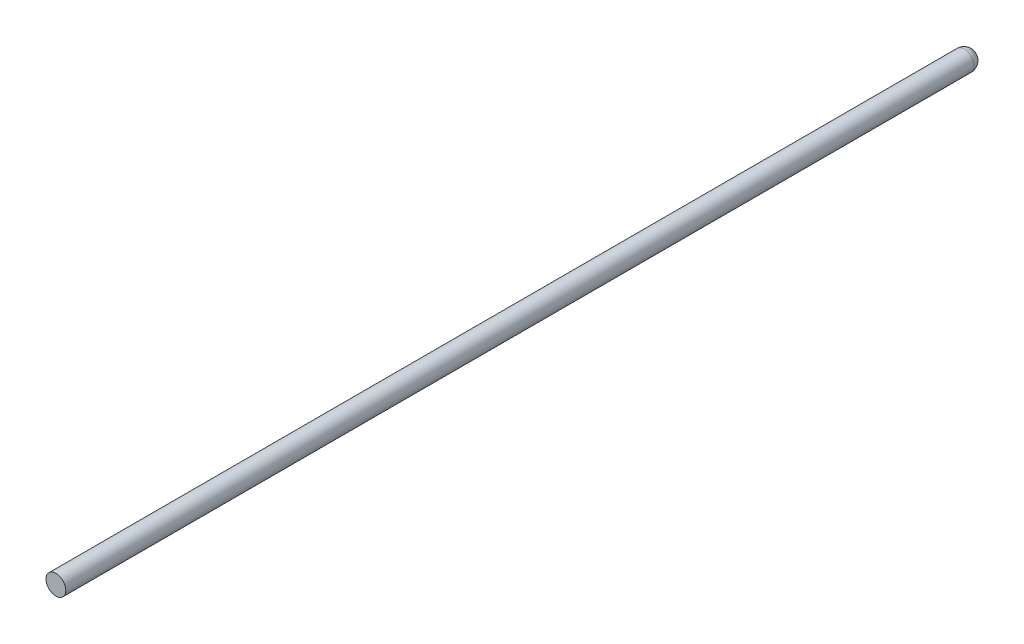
ISO-10303-21;
HEADER;
FILE_DESCRIPTION(('STEP AP214'),'2;1');
FILE_NAME('part.step','',(''),(''),'','','');
FILE_SCHEMA(('AUTOMOTIVE_DESIGN { 1 0 10303 214 1 1 1 1 }'));
ENDSEC;
DATA;
#1=APPLICATION_CONTEXT('core data for automotive mechanical design processes');
#2=APPLICATION_PROTOCOL_DEFINITION('international standard','automotive_design',2000,#1);
#3=PRODUCT_CONTEXT('',#1,'mechanical');
#4=PRODUCT('Part','Part','',(#3));
#5=PRODUCT_RELATED_PRODUCT_CATEGORY('part','',(#4));
#6=PRODUCT_DEFINITION_FORMATION('','',#4);
#7=PRODUCT_DEFINITION_CONTEXT('part definition',#1,'design');
#8=PRODUCT_DEFINITION('design','',#6,#7);
#9=PRODUCT_DEFINITION_SHAPE('','',#8);
#10=(LENGTH_UNIT() NAMED_UNIT(*) SI_UNIT(.MILLI.,.METRE.));
#11=(NAMED_UNIT(*) PLANE_ANGLE_UNIT() SI_UNIT($,.RADIAN.));
#12=(NAMED_UNIT(*) SI_UNIT($,.STERADIAN.) SOLID_ANGLE_UNIT());
#13=UNCERTAINTY_MEASURE_WITH_UNIT(LENGTH_MEASURE(1.E-05),#10,'distance_accuracy_value','');
#14=(GEOMETRIC_REPRESENTATION_CONTEXT(3) GLOBAL_UNCERTAINTY_ASSIGNED_CONTEXT((#13)) GLOBAL_UNIT_ASSIGNED_CONTEXT((#10,
#11,#12)) REPRESENTATION_CONTEXT('',''));
#15=CARTESIAN_POINT('',(0.,0.,0.));
#16=DIRECTION('',(0.,0.,1.));
#17=DIRECTION('',(1.,0.,0.));
#18=AXIS2_PLACEMENT_3D('',#15,#16,#17);
#19=CARTESIAN_POINT('',(0.,0.,650.));
#20=DIRECTION('',(0.,0.,-1.));
#21=DIRECTION('',(-1.,0.,0.));
#22=AXIS2_PLACEMENT_3D('',#19,#20,#21);
#23=CYLINDRICAL_SURFACE('',#22,7.);
#24=CARTESIAN_POINT('',(0.,0.,7.00000000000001));
#25=DIRECTION('',(0.,0.,-1.));
#26=DIRECTION('',(-1.,0.,0.));
#27=AXIS2_PLACEMENT_3D('',#24,#25,#26);
#28=CIRCLE('',#27,7.);
#29=CARTESIAN_POINT('',(-7.,0.,7.00000000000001));
#30=VERTEX_POINT('',#29);
#31=EDGE_CURVE('E10',#30,#30,#28,.F.);
#32=ORIENTED_EDGE('',*,*,#31,.T.);
#33=EDGE_LOOP('',(#32));
#34=FACE_BOUND('',#33,.T.);
#35=CARTESIAN_POINT('',(0.,0.,650.));
#36=DIRECTION('',(0.,0.,1.));
#37=DIRECTION('',(1.,0.,0.));
#38=AXIS2_PLACEMENT_3D('',#35,#36,#37);
#39=CIRCLE('',#38,7.);
#40=CARTESIAN_POINT('',(7.,0.,650.));
#41=VERTEX_POINT('',#40);
#42=EDGE_CURVE('E38',#41,#41,#39,.T.);
#43=ORIENTED_EDGE('',*,*,#42,.F.);
#44=EDGE_LOOP('',(#43));
#45=FACE_BOUND('',#44,.T.);
#46=ADVANCED_FACE('F31',(#34,#45),#23,.T.);
#47=CARTESIAN_POINT('',(0.,0.,650.));
#48=DIRECTION('',(0.,0.,1.));
#49=DIRECTION('',(1.,0.,0.));
#50=AXIS2_PLACEMENT_3D('',#47,#48,#49);
#51=PLANE('',#50);
#52=ORIENTED_EDGE('',*,*,#42,.T.);
#53=EDGE_LOOP('',(#52));
#54=FACE_BOUND('',#53,.T.);
#55=ADVANCED_FACE('F44',(#54),#51,.T.);
#56=CARTESIAN_POINT('',(0.,0.,7.00000000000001));
#57=DIRECTION('',(0.,0.,1.));
#58=DIRECTION('',(1.,0.,0.));
#59=AXIS2_PLACEMENT_3D('',#56,#57,#58);
#60=SPHERICAL_SURFACE('',#59,7.);
#61=ORIENTED_EDGE('',*,*,#31,.F.);
#62=EDGE_LOOP('',(#61));
#63=FACE_BOUND('',#62,.T.);
#64=ADVANCED_FACE('F33',(#63),#60,.T.);
#65=CLOSED_SHELL('',(#46,#55,#64));
#66=MANIFOLD_SOLID_BREP('B2',#65);
#67=ADVANCED_BREP_SHAPE_REPRESENTATION('',(#18,#66),#14);
#68=SHAPE_DEFINITION_REPRESENTATION(#9,#67);
ENDSEC;
END-ISO-10303-21;
